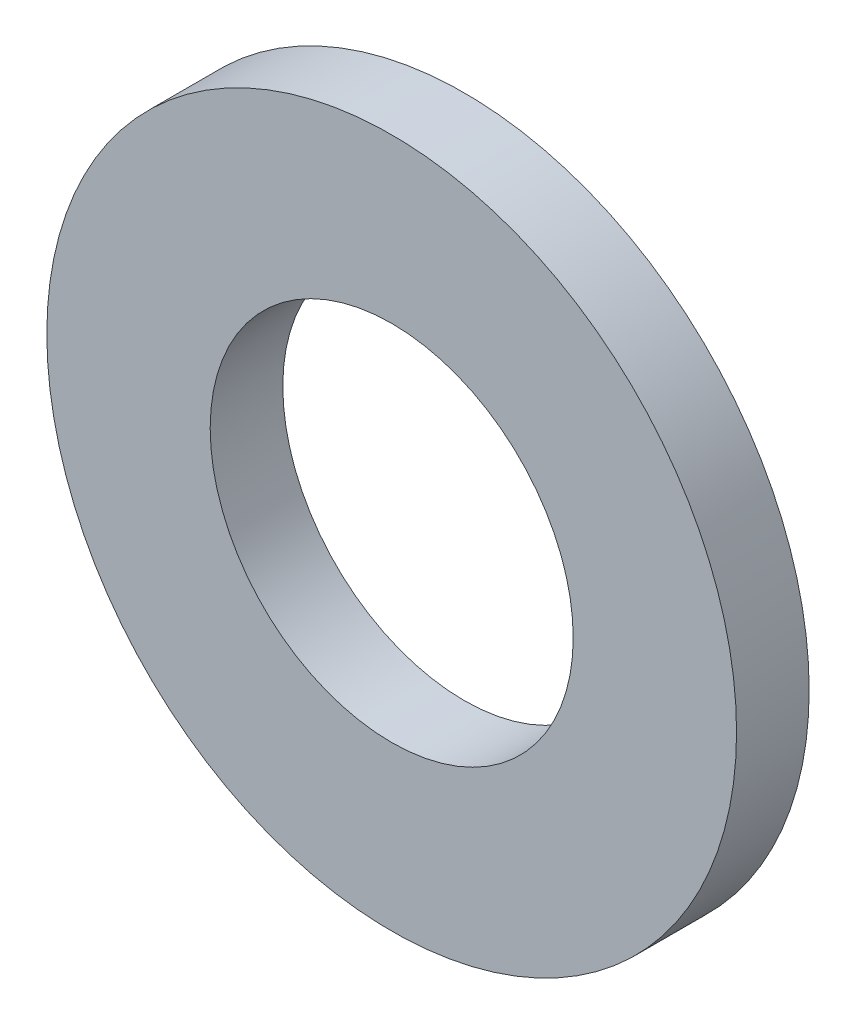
ISO-10303-21;
HEADER;
FILE_DESCRIPTION(('STEP AP214'),'2;1');
FILE_NAME('part.step','',(''),(''),'','','');
FILE_SCHEMA(('AUTOMOTIVE_DESIGN { 1 0 10303 214 1 1 1 1 }'));
ENDSEC;
DATA;
#1=APPLICATION_CONTEXT('core data for automotive mechanical design processes');
#2=APPLICATION_PROTOCOL_DEFINITION('international standard','automotive_design',2000,#1);
#3=PRODUCT_CONTEXT('',#1,'mechanical');
#4=PRODUCT('Part','Part','',(#3));
#5=PRODUCT_RELATED_PRODUCT_CATEGORY('part','',(#4));
#6=PRODUCT_DEFINITION_FORMATION('','',#4);
#7=PRODUCT_DEFINITION_CONTEXT('part definition',#1,'design');
#8=PRODUCT_DEFINITION('design','',#6,#7);
#9=PRODUCT_DEFINITION_SHAPE('','',#8);
#10=(LENGTH_UNIT() NAMED_UNIT(*) SI_UNIT(.MILLI.,.METRE.));
#11=(NAMED_UNIT(*) PLANE_ANGLE_UNIT() SI_UNIT($,.RADIAN.));
#12=(NAMED_UNIT(*) SI_UNIT($,.STERADIAN.) SOLID_ANGLE_UNIT());
#13=UNCERTAINTY_MEASURE_WITH_UNIT(LENGTH_MEASURE(1.E-05),#10,'distance_accuracy_value','');
#14=(GEOMETRIC_REPRESENTATION_CONTEXT(3) GLOBAL_UNCERTAINTY_ASSIGNED_CONTEXT((#13)) GLOBAL_UNIT_ASSIGNED_CONTEXT((#10,
#11,#12)) REPRESENTATION_CONTEXT('',''));
#15=CARTESIAN_POINT('',(0.,0.,0.));
#16=DIRECTION('',(0.,0.,1.));
#17=DIRECTION('',(1.,0.,0.));
#18=AXIS2_PLACEMENT_3D('',#15,#16,#17);
#19=CARTESIAN_POINT('',(0.,0.,3.));
#20=DIRECTION('',(0.,0.,1.));
#21=DIRECTION('',(1.,0.,0.));
#22=AXIS2_PLACEMENT_3D('',#19,#20,#21);
#23=PLANE('',#22);
#24=CARTESIAN_POINT('',(0.,0.,3.));
#25=DIRECTION('',(0.,0.,1.));
#26=DIRECTION('',(1.,0.,0.));
#27=AXIS2_PLACEMENT_3D('',#24,#25,#26);
#28=CIRCLE('',#27,28.5);
#29=CARTESIAN_POINT('',(28.5,0.,3.));
#30=VERTEX_POINT('',#29);
#31=EDGE_CURVE('E10',#30,#30,#28,.T.);
#32=ORIENTED_EDGE('',*,*,#31,.T.);
#33=EDGE_LOOP('',(#32));
#34=FACE_BOUND('',#33,.T.);
#35=CARTESIAN_POINT('',(0.,0.,3.));
#36=DIRECTION('',(0.,0.,1.));
#37=DIRECTION('',(1.,0.,0.));
#38=AXIS2_PLACEMENT_3D('',#35,#36,#37);
#39=CIRCLE('',#38,15.);
#40=CARTESIAN_POINT('',(15.,0.,3.));
#41=VERTEX_POINT('',#40);
#42=EDGE_CURVE('E42',#41,#41,#39,.T.);
#43=ORIENTED_EDGE('',*,*,#42,.F.);
#44=EDGE_LOOP('',(#43));
#45=FACE_BOUND('',#44,.T.);
#46=ADVANCED_FACE('F35',(#34,#45),#23,.T.);
#47=CARTESIAN_POINT('',(0.,0.,3.));
#48=DIRECTION('',(0.,0.,-1.));
#49=DIRECTION('',(-1.,0.,0.));
#50=AXIS2_PLACEMENT_3D('',#47,#48,#49);
#51=CYLINDRICAL_SURFACE('',#50,28.5);
#52=ORIENTED_EDGE('',*,*,#31,.F.);
#53=EDGE_LOOP('',(#52));
#54=FACE_BOUND('',#53,.T.);
#55=CARTESIAN_POINT('',(0.,0.,-3.));
#56=DIRECTION('',(0.,0.,1.));
#57=DIRECTION('',(1.,0.,0.));
#58=AXIS2_PLACEMENT_3D('',#55,#56,#57);
#59=CIRCLE('',#58,28.5);
#60=CARTESIAN_POINT('',(28.5,0.,-3.));
#61=VERTEX_POINT('',#60);
#62=EDGE_CURVE('E46',#61,#61,#59,.T.);
#63=ORIENTED_EDGE('',*,*,#62,.T.);
#64=EDGE_LOOP('',(#63));
#65=FACE_BOUND('',#64,.T.);
#66=ADVANCED_FACE('F37',(#54,#65),#51,.T.);
#67=CARTESIAN_POINT('',(0.,0.,3.));
#68=DIRECTION('',(0.,0.,-1.));
#69=DIRECTION('',(-1.,0.,0.));
#70=AXIS2_PLACEMENT_3D('',#67,#68,#69);
#71=CYLINDRICAL_SURFACE('',#70,15.);
#72=ORIENTED_EDGE('',*,*,#42,.T.);
#73=EDGE_LOOP('',(#72));
#74=FACE_BOUND('',#73,.T.);
#75=CARTESIAN_POINT('',(0.,0.,-3.));
#76=DIRECTION('',(0.,0.,1.));
#77=DIRECTION('',(1.,0.,0.));
#78=AXIS2_PLACEMENT_3D('',#75,#76,#77);
#79=CIRCLE('',#78,15.);
#80=CARTESIAN_POINT('',(15.,0.,-3.));
#81=VERTEX_POINT('',#80);
#82=EDGE_CURVE('E50',#81,#81,#79,.T.);
#83=ORIENTED_EDGE('',*,*,#82,.F.);
#84=EDGE_LOOP('',(#83));
#85=FACE_BOUND('',#84,.T.);
#86=ADVANCED_FACE('F59',(#74,#85),#71,.F.);
#87=CARTESIAN_POINT('',(0.,0.,-3.));
#88=DIRECTION('',(0.,0.,1.));
#89=DIRECTION('',(1.,0.,0.));
#90=AXIS2_PLACEMENT_3D('',#87,#88,#89);
#91=PLANE('',#90);
#92=ORIENTED_EDGE('',*,*,#82,.T.);
#93=EDGE_LOOP('',(#92));
#94=FACE_BOUND('',#93,.T.);
#95=ORIENTED_EDGE('',*,*,#62,.F.);
#96=EDGE_LOOP('',(#95));
#97=FACE_BOUND('',#96,.T.);
#98=ADVANCED_FACE('F56',(#94,#97),#91,.F.);
#99=CLOSED_SHELL('',(#46,#66,#86,#98));
#100=MANIFOLD_SOLID_BREP('B2',#99);
#101=ADVANCED_BREP_SHAPE_REPRESENTATION('',(#18,#100),#14);
#102=SHAPE_DEFINITION_REPRESENTATION(#9,#101);
ENDSEC;
END-ISO-10303-21;
